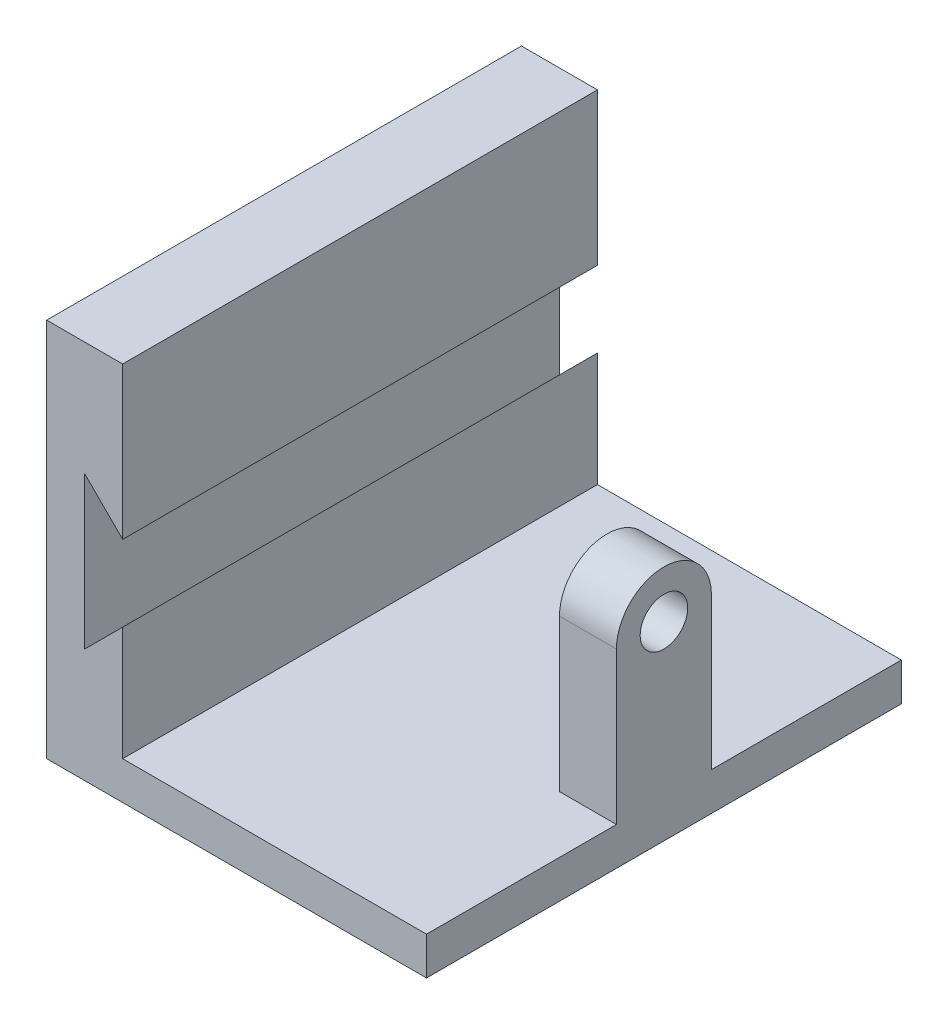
from build123d import *

# Parameters (mm, degrees)
BOSS_EXTRUDE1_DEPTH = 125
SKETCH2_R           = 12.5
BOSS_EXTRUDE2_DEPTH = 30


with BuildPart() as part:
    # Sketch1 → Boss-Extrude1 (new, symmetric)
    with BuildSketch(Plane.XY):
        Polygon((0, 0), (-200, 0), (-200, 200), (-160, 200), (-160, 120), (-180, 140), (-180, 60), (-160, 80), (-160, 20), (0, 20), align=None)
    extrude(amount=BOSS_EXTRUDE1_DEPTH, both=True)

    # Sketch2 → Boss-Extrude2 (add)
    with BuildSketch(Plane(origin=(0, 0, 0), x_dir=(0, 0, -1), z_dir=(1, 0, 0))):
        with BuildLine():
            Line((-25, 100), (-25, 0))
            Line((-25, 0), (0, 0))
            Line((0, 0), (25, 0))
            Line((25, 0), (25, 100))
            ThreePointArc((25, 100), (0, 125), (-25, 100))
        make_face()
        with Locations(Location((0, 100, 0), (0, 0, 90))):
            Circle(SKETCH2_R, mode=Mode.SUBTRACT)
    extrude(amount=-BOSS_EXTRUDE2_DEPTH)


solid = part.part
